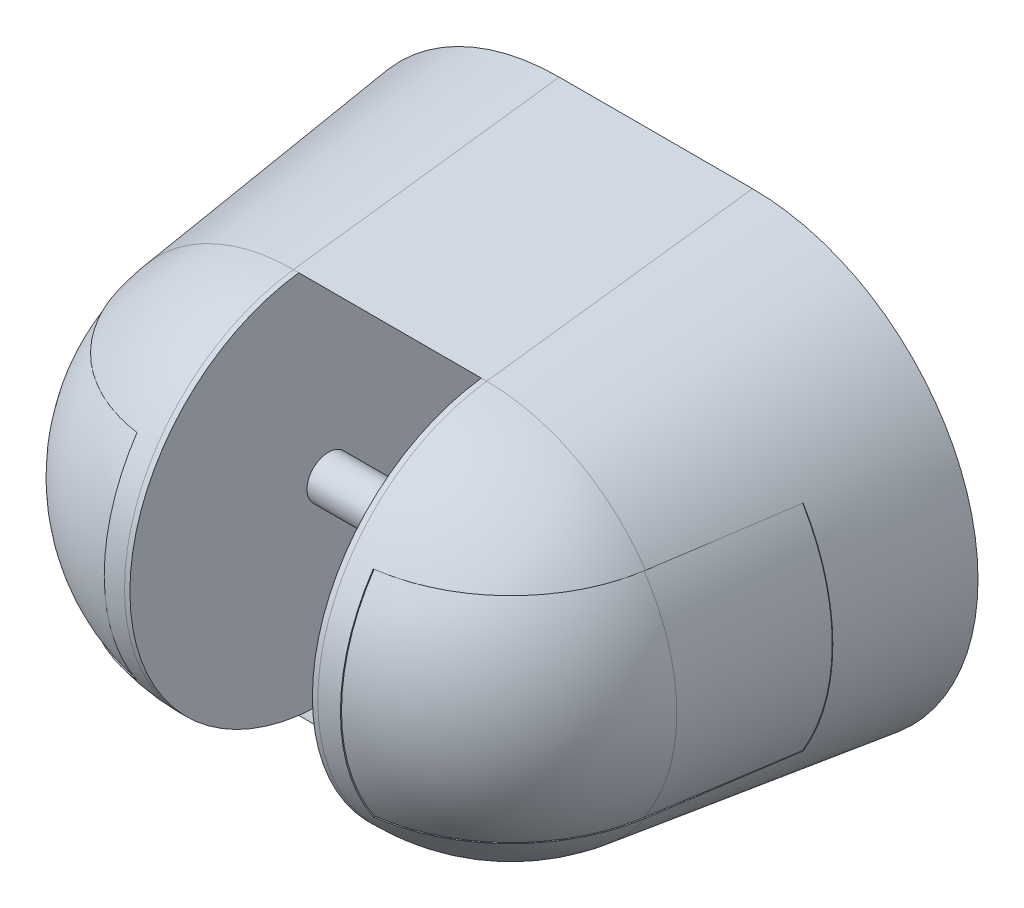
ISO-10303-21;
HEADER;
FILE_DESCRIPTION(('STEP AP214'),'2;1');
FILE_NAME('part.step','',(''),(''),'','','');
FILE_SCHEMA(('AUTOMOTIVE_DESIGN { 1 0 10303 214 1 1 1 1 }'));
ENDSEC;
DATA;
#1=APPLICATION_CONTEXT('core data for automotive mechanical design processes');
#2=APPLICATION_PROTOCOL_DEFINITION('international standard','automotive_design',2000,#1);
#3=PRODUCT_CONTEXT('',#1,'mechanical');
#4=PRODUCT('Part','Part','',(#3));
#5=PRODUCT_RELATED_PRODUCT_CATEGORY('part','',(#4));
#6=PRODUCT_DEFINITION_FORMATION('','',#4);
#7=PRODUCT_DEFINITION_CONTEXT('part definition',#1,'design');
#8=PRODUCT_DEFINITION('design','',#6,#7);
#9=PRODUCT_DEFINITION_SHAPE('','',#8);
#10=(LENGTH_UNIT() NAMED_UNIT(*) SI_UNIT(.MILLI.,.METRE.));
#11=(NAMED_UNIT(*) PLANE_ANGLE_UNIT() SI_UNIT($,.RADIAN.));
#12=(NAMED_UNIT(*) SI_UNIT($,.STERADIAN.) SOLID_ANGLE_UNIT());
#13=UNCERTAINTY_MEASURE_WITH_UNIT(LENGTH_MEASURE(1.E-05),#10,'distance_accuracy_value','');
#14=(GEOMETRIC_REPRESENTATION_CONTEXT(3) GLOBAL_UNCERTAINTY_ASSIGNED_CONTEXT((#13)) GLOBAL_UNIT_ASSIGNED_CONTEXT((#10,
#11,#12)) REPRESENTATION_CONTEXT('',''));
#15=CARTESIAN_POINT('',(0.,0.,0.));
#16=DIRECTION('',(0.,0.,1.));
#17=DIRECTION('',(1.,0.,0.));
#18=AXIS2_PLACEMENT_3D('',#15,#16,#17);
#19=CARTESIAN_POINT('',(22.625,0.,11.5));
#20=DIRECTION('',(0.,0.,1.));
#21=DIRECTION('',(0.,-1.,0.));
#22=AXIS2_PLACEMENT_3D('',#19,#20,#21);
#23=PLANE('',#22);
#24=CARTESIAN_POINT('',(20.,0.,11.5));
#25=DIRECTION('',(0.,0.,-1.));
#26=DIRECTION('',(0.,1.,0.));
#27=AXIS2_PLACEMENT_3D('',#24,#25,#26);
#28=CIRCLE('',#27,5.25);
#29=CARTESIAN_POINT('',(20.,5.25,11.5));
#30=VERTEX_POINT('',#29);
#31=EDGE_CURVE('E17',#30,#30,#28,.T.);
#32=ORIENTED_EDGE('',*,*,#31,.T.);
#33=EDGE_LOOP('',(#32));
#34=FACE_BOUND('',#33,.T.);
#35=ADVANCED_FACE('F14',(#34),#23,.F.);
#36=CARTESIAN_POINT('',(-17.375,0.,11.5));
#37=DIRECTION('',(0.,0.,1.));
#38=DIRECTION('',(0.,-1.,0.));
#39=AXIS2_PLACEMENT_3D('',#36,#37,#38);
#40=PLANE('',#39);
#41=CARTESIAN_POINT('',(-20.,0.,11.5));
#42=DIRECTION('',(0.,0.,-1.));
#43=DIRECTION('',(0.,1.,0.));
#44=AXIS2_PLACEMENT_3D('',#41,#42,#43);
#45=CIRCLE('',#44,5.25);
#46=CARTESIAN_POINT('',(-20.,5.25,11.5));
#47=VERTEX_POINT('',#46);
#48=EDGE_CURVE('E439',#47,#47,#45,.T.);
#49=ORIENTED_EDGE('',*,*,#48,.T.);
#50=EDGE_LOOP('',(#49));
#51=FACE_BOUND('',#50,.T.);
#52=ADVANCED_FACE('F527',(#51),#40,.F.);
#53=CARTESIAN_POINT('',(20.,0.,8.25));
#54=DIRECTION('',(0.,0.,-1.));
#55=DIRECTION('',(0.,1.,0.));
#56=AXIS2_PLACEMENT_3D('',#53,#54,#55);
#57=CYLINDRICAL_SURFACE('',#56,5.25);
#58=ORIENTED_EDGE('',*,*,#31,.F.);
#59=EDGE_LOOP('',(#58));
#60=FACE_BOUND('',#59,.T.);
#61=CARTESIAN_POINT('',(20.,0.,5.));
#62=DIRECTION('',(0.,0.,-1.));
#63=DIRECTION('',(0.,1.,0.));
#64=AXIS2_PLACEMENT_3D('',#61,#62,#63);
#65=CIRCLE('',#64,5.25);
#66=CARTESIAN_POINT('',(20.,5.25,5.));
#67=VERTEX_POINT('',#66);
#68=EDGE_CURVE('E458',#67,#67,#65,.T.);
#69=ORIENTED_EDGE('',*,*,#68,.T.);
#70=EDGE_LOOP('',(#69));
#71=FACE_BOUND('',#70,.T.);
#72=ADVANCED_FACE('F533',(#60,#71),#57,.F.);
#73=CARTESIAN_POINT('',(-20.,0.,8.25));
#74=DIRECTION('',(0.,0.,-1.));
#75=DIRECTION('',(0.,1.,0.));
#76=AXIS2_PLACEMENT_3D('',#73,#74,#75);
#77=CYLINDRICAL_SURFACE('',#76,5.25);
#78=ORIENTED_EDGE('',*,*,#48,.F.);
#79=EDGE_LOOP('',(#78));
#80=FACE_BOUND('',#79,.T.);
#81=CARTESIAN_POINT('',(-20.,0.,5.));
#82=DIRECTION('',(0.,0.,-1.));
#83=DIRECTION('',(0.,1.,0.));
#84=AXIS2_PLACEMENT_3D('',#81,#82,#83);
#85=CIRCLE('',#84,5.25);
#86=CARTESIAN_POINT('',(-20.,5.25,5.));
#87=VERTEX_POINT('',#86);
#88=EDGE_CURVE('E461',#87,#87,#85,.T.);
#89=ORIENTED_EDGE('',*,*,#88,.T.);
#90=EDGE_LOOP('',(#89));
#91=FACE_BOUND('',#90,.T.);
#92=ADVANCED_FACE('F538',(#80,#91),#77,.F.);
#93=CARTESIAN_POINT('',(11.,0.,0.));
#94=DIRECTION('',(1.,0.,0.));
#95=DIRECTION('',(0.,1.,0.));
#96=AXIS2_PLACEMENT_3D('',#93,#94,#95);
#97=PLANE('',#96);
#98=CARTESIAN_POINT('',(11.,0.,22.5));
#99=DIRECTION('',(1.,0.,0.));
#100=DIRECTION('',(0.,1.,0.));
#101=AXIS2_PLACEMENT_3D('',#98,#99,#100);
#102=CIRCLE('',#101,17.8885438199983);
#103=CARTESIAN_POINT('',(11.,-10.,37.3323969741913));
#104=VERTEX_POINT('',#103);
#105=CARTESIAN_POINT('',(11.,10.,37.3323969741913));
#106=VERTEX_POINT('',#105);
#107=EDGE_CURVE('E406',#104,#106,#102,.F.);
#108=ORIENTED_EDGE('',*,*,#107,.F.);
#109=DIRECTION('',(0.,0.,1.));
#110=VECTOR('',#109,1.);
#111=CARTESIAN_POINT('',(11.,-10.,12.));
#112=LINE('',#111,#110);
#113=CARTESIAN_POINT('',(11.,-10.,37.2108803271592));
#114=VERTEX_POINT('',#113);
#115=EDGE_CURVE('E414',#104,#114,#112,.F.);
#116=ORIENTED_EDGE('',*,*,#115,.T.);
#117=CARTESIAN_POINT('',(11.,0.,22.5));
#118=DIRECTION('',(1.,0.,0.));
#119=DIRECTION('',(0.,1.,0.));
#120=AXIS2_PLACEMENT_3D('',#117,#118,#119);
#121=CIRCLE('',#120,17.7879172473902);
#122=CARTESIAN_POINT('',(11.,10.,37.2108803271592));
#123=VERTEX_POINT('',#122);
#124=EDGE_CURVE('E438',#123,#114,#121,.T.);
#125=ORIENTED_EDGE('',*,*,#124,.F.);
#126=DIRECTION('',(0.,0.,1.));
#127=VECTOR('',#126,1.);
#128=CARTESIAN_POINT('',(11.,10.,0.));
#129=LINE('',#128,#127);
#130=EDGE_CURVE('E437',#123,#106,#129,.T.);
#131=ORIENTED_EDGE('',*,*,#130,.T.);
#132=EDGE_LOOP('',(#108,#116,#125,#131));
#133=FACE_BOUND('',#132,.T.);
#134=ADVANCED_FACE('F427',(#133),#97,.T.);
#135=CARTESIAN_POINT('',(9.,0.,22.5));
#136=DIRECTION('',(1.,0.,0.));
#137=DIRECTION('',(0.,0.,1.));
#138=AXIS2_PLACEMENT_3D('',#135,#136,#137);
#139=SPHERICAL_SURFACE('',#138,17.9);
#140=CARTESIAN_POINT('',(23.6641836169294,10.,24.8176968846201));
#141=CARTESIAN_POINT('',(23.5990474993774,10.,25.230103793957));
#142=CARTESIAN_POINT('',(23.5164287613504,10.,25.6397409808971));
#143=CARTESIAN_POINT('',(23.3170103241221,10.,26.450589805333));
#144=CARTESIAN_POINT('',(23.200212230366,10.,26.8518018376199));
#145=CARTESIAN_POINT('',(22.933284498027,10.,27.642741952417));
#146=CARTESIAN_POINT('',(22.7831727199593,10.,28.0324760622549));
#147=CARTESIAN_POINT('',(22.4506644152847,10.,28.7979134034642));
#148=CARTESIAN_POINT('',(22.2682683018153,10.,29.1736168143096));
#149=CARTESIAN_POINT('',(21.8723999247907,10.,29.9084804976));
#150=CARTESIAN_POINT('',(21.6589147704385,10.,30.2676338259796));
#151=CARTESIAN_POINT('',(21.2024439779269,10.,30.9666767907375));
#152=CARTESIAN_POINT('',(20.9594583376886,10.,31.3065664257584));
#153=CARTESIAN_POINT('',(20.4457777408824,10.,31.9645836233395));
#154=CARTESIAN_POINT('',(20.1750896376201,10.,32.2827165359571));
#155=CARTESIAN_POINT('',(19.6078822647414,10.,32.8950468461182));
#156=CARTESIAN_POINT('',(19.3113633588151,10.,33.1892445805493));
#157=CARTESIAN_POINT('',(18.6945594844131,10.,33.7516544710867));
#158=CARTESIAN_POINT('',(18.3742714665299,10.,34.0198632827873));
#159=CARTESIAN_POINT('',(17.7122246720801,10.,34.5283565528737));
#160=CARTESIAN_POINT('',(17.3704650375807,10.,34.7686398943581));
#161=CARTESIAN_POINT('',(16.6679152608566,10.,35.2195644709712));
#162=CARTESIAN_POINT('',(16.3071246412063,10.,35.4302049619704));
#163=CARTESIAN_POINT('',(15.5691121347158,10.,35.8203198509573));
#164=CARTESIAN_POINT('',(15.1918926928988,10.,35.9997988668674));
#165=CARTESIAN_POINT('',(14.5038390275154,10.,36.2922770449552));
#166=CARTESIAN_POINT('',(14.1955620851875,10.,36.4113348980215));
#167=CARTESIAN_POINT('',(13.5717877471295,10.,36.6286165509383));
#168=CARTESIAN_POINT('',(13.2562914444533,10.,36.7268434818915));
#169=CARTESIAN_POINT('',(12.6198021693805,10.,36.901938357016));
#170=CARTESIAN_POINT('',(12.2988155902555,10.,36.9788295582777));
#171=CARTESIAN_POINT('',(11.6523831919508,10.,37.1110867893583));
#172=CARTESIAN_POINT('',(11.3269366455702,10.,37.1664492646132));
#173=CARTESIAN_POINT('',(11.,10.,37.2108803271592));
#174=B_SPLINE_CURVE_WITH_KNOTS('',3,(#140,#141,#142,#143,#144,#145,#146,#147,#148,#149,#150,
#151,#152,#153,#154,#155,#156,#157,#158,#159,#160,#161,#162,#163,#164,#165,#166,#167,#168,#169,
#170,#171,#172,#173),.UNSPECIFIED.,.F.,.F.,(4,2,2,2,2,2,2,2,2,2,2,2,2,2,2,2,4),(0.,
1.25217488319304,2.50429095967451,3.75573735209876,5.00716773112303,6.25911849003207,
7.51106933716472,8.7627112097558,10.0143354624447,11.2661205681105,12.5179557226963,
13.7698222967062,15.0215031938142,16.0122083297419,17.0027644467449,17.9922365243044,
18.9818719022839),.UNSPECIFIED.);
#175=CARTESIAN_POINT('',(23.6641836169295,10.,24.8176968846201));
#176=VERTEX_POINT('',#175);
#177=EDGE_CURVE('E381',#176,#123,#174,.T.);
#178=ORIENTED_EDGE('',*,*,#177,.T.);
#179=ORIENTED_EDGE('',*,*,#124,.T.);
#180=CARTESIAN_POINT('',(11.,-10.,37.2108803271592));
#181=CARTESIAN_POINT('',(11.4137191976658,-10.,37.1546789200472));
#182=CARTESIAN_POINT('',(11.82504743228,-10.,37.0809390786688));
#183=CARTESIAN_POINT('',(12.6400195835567,-10.,36.8991042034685));
#184=CARTESIAN_POINT('',(13.0436638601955,-10.,36.7910107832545));
#185=CARTESIAN_POINT('',(13.8401920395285,-10.,36.5412518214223));
#186=CARTESIAN_POINT('',(14.2330815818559,-10.,36.3996042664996));
#187=CARTESIAN_POINT('',(15.0055313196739,-10.,36.0837285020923));
#188=CARTESIAN_POINT('',(15.3850916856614,-10.,35.9095007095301));
#189=CARTESIAN_POINT('',(16.1283452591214,-10.,35.5296184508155));
#190=CARTESIAN_POINT('',(16.492031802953,-10.,35.3239509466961));
#191=CARTESIAN_POINT('',(17.2007837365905,-10.,34.8827057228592));
#192=CARTESIAN_POINT('',(17.5458491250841,-10.,34.6471280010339));
#193=CARTESIAN_POINT('',(18.2148222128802,-10.,34.1477990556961));
#194=CARTESIAN_POINT('',(18.5387351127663,-10.,33.8840547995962));
#195=CARTESIAN_POINT('',(19.1631896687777,-10.,33.3302234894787));
#196=CARTESIAN_POINT('',(19.4637316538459,-10.,33.0401368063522));
#197=CARTESIAN_POINT('',(20.0393501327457,-10.,32.4356409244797));
#198=CARTESIAN_POINT('',(20.314423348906,-10.,32.1212286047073));
#199=CARTESIAN_POINT('',(20.8371163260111,-10.,31.470334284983));
#200=CARTESIAN_POINT('',(21.0847349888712,-10.,31.1338514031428));
#201=CARTESIAN_POINT('',(21.5507487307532,-10.,30.4412184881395));
#202=CARTESIAN_POINT('',(21.7691430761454,-10.,30.0850679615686));
#203=CARTESIAN_POINT('',(22.1751283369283,-10.,29.3556654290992));
#204=CARTESIAN_POINT('',(22.3627238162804,-10.,28.9824159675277));
#205=CARTESIAN_POINT('',(22.6700147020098,-10.,28.3008489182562));
#206=CARTESIAN_POINT('',(22.7957120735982,-10.,27.9952190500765));
#207=CARTESIAN_POINT('',(23.0264337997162,-10.,27.3762899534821));
#208=CARTESIAN_POINT('',(23.1314612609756,-10.,27.0629918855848));
#209=CARTESIAN_POINT('',(23.3202810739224,-10.,26.4304384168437));
#210=CARTESIAN_POINT('',(23.4040965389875,-10.,26.1111899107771));
#211=CARTESIAN_POINT('',(23.5503037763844,-10.,25.4677691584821));
#212=CARTESIAN_POINT('',(23.6126920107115,-10.,25.1435961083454));
#213=CARTESIAN_POINT('',(23.6641836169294,-10.,24.8176968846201));
#214=B_SPLINE_CURVE_WITH_KNOTS('',3,(#180,#181,#182,#183,#184,#185,#186,#187,#188,#189,#190,
#191,#192,#193,#194,#195,#196,#197,#198,#199,#200,#201,#202,#203,#204,#205,#206,#207,#208,#209,
#210,#211,#212,#213),.UNSPECIFIED.,.F.,.F.,(4,2,2,2,2,2,2,2,2,2,2,2,2,2,2,2,4),(0.,
1.25217488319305,2.50429095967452,3.75573735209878,5.00716773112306,6.25911849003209,
7.51106933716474,8.76271120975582,10.0143354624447,11.2661205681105,12.5179557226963,
13.7698222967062,15.0215031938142,16.0122083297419,17.0027644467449,17.9922365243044,
18.9818719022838),.UNSPECIFIED.);
#215=CARTESIAN_POINT('',(23.6641836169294,-10.,24.8176968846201));
#216=VERTEX_POINT('',#215);
#217=EDGE_CURVE('E407',#114,#216,#214,.T.);
#218=ORIENTED_EDGE('',*,*,#217,.T.);
#219=CARTESIAN_POINT('',(9.,0.,24.8176968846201));
#220=DIRECTION('',(0.,0.,-1.));
#221=DIRECTION('',(0.,1.,0.));
#222=AXIS2_PLACEMENT_3D('',#219,#220,#221);
#223=CIRCLE('',#222,17.749317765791);
#224=EDGE_CURVE('E445',#176,#216,#223,.T.);
#225=ORIENTED_EDGE('',*,*,#224,.F.);
#226=EDGE_LOOP('',(#178,#179,#218,#225));
#227=FACE_BOUND('',#226,.T.);
#228=ADVANCED_FACE('F421',(#227),#139,.T.);
#229=CARTESIAN_POINT('',(9.,0.,12.));
#230=DIRECTION('',(0.,0.,-1.));
#231=DIRECTION('',(0.,1.,0.));
#232=AXIS2_PLACEMENT_3D('',#229,#230,#231);
#233=CONICAL_SURFACE('',#232,19.4230461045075,0.129844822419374);
#234=CARTESIAN_POINT('',(25.6509675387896,10.,12.));
#235=CARTESIAN_POINT('',(25.4882013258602,10.,13.0685737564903));
#236=CARTESIAN_POINT('',(25.3248218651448,10.,14.1370542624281));
#237=CARTESIAN_POINT('',(24.9967104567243,10.,16.2738054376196));
#238=CARTESIAN_POINT('',(24.83197851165,10.,17.3420761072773));
#239=CARTESIAN_POINT('',(24.5010354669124,10.,19.4783887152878));
#240=CARTESIAN_POINT('',(24.3348243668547,10.,20.5464306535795));
#241=CARTESIAN_POINT('',(24.0007681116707,10.,22.6822610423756));
#242=CARTESIAN_POINT('',(23.8329229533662,10.,23.7500494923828));
#243=CARTESIAN_POINT('',(23.6641836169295,10.,24.8176968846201));
#244=B_SPLINE_CURVE_WITH_KNOTS('',3,(#234,#235,#236,#237,#238,#239,#240,#241,#242,#243),
.UNSPECIFIED.,.F.,.F.,(4,2,2,2,4),(0.,3.24269713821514,6.48538797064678,9.72807966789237,
12.9707776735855),.UNSPECIFIED.);
#245=CARTESIAN_POINT('',(25.6509675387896,10.,12.));
#246=VERTEX_POINT('',#245);
#247=EDGE_CURVE('E376',#246,#176,#244,.T.);
#248=ORIENTED_EDGE('',*,*,#247,.T.);
#249=ORIENTED_EDGE('',*,*,#224,.T.);
#250=CARTESIAN_POINT('',(23.6641836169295,-10.,24.8176968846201));
#251=CARTESIAN_POINT('',(23.8329229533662,-10.,23.7500494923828));
#252=CARTESIAN_POINT('',(24.0007681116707,-10.,22.6822610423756));
#253=CARTESIAN_POINT('',(24.3348243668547,-10.,20.5464306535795));
#254=CARTESIAN_POINT('',(24.5010354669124,-10.,19.4783887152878));
#255=CARTESIAN_POINT('',(24.83197851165,-10.,17.3420761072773));
#256=CARTESIAN_POINT('',(24.9967104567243,-10.,16.2738054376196));
#257=CARTESIAN_POINT('',(25.3248218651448,-10.,14.1370542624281));
#258=CARTESIAN_POINT('',(25.4882013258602,-10.,13.0685737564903));
#259=CARTESIAN_POINT('',(25.6509675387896,-10.,12.));
#260=B_SPLINE_CURVE_WITH_KNOTS('',3,(#250,#251,#252,#253,#254,#255,#256,#257,#258,#259),
.UNSPECIFIED.,.F.,.F.,(4,2,2,2,4),(0.,3.24269800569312,6.48538970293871,9.72808053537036,
12.9707776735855),.UNSPECIFIED.);
#261=CARTESIAN_POINT('',(25.6509675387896,-10.,12.));
#262=VERTEX_POINT('',#261);
#263=EDGE_CURVE('E415',#216,#262,#260,.T.);
#264=ORIENTED_EDGE('',*,*,#263,.T.);
#265=CARTESIAN_POINT('',(9.,0.,12.));
#266=DIRECTION('',(0.,0.,-1.));
#267=DIRECTION('',(0.,1.,0.));
#268=AXIS2_PLACEMENT_3D('',#265,#266,#267);
#269=CIRCLE('',#268,19.4230461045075);
#270=EDGE_CURVE('E161',#262,#246,#269,.F.);
#271=ORIENTED_EDGE('',*,*,#270,.T.);
#272=EDGE_LOOP('',(#248,#249,#264,#271));
#273=FACE_BOUND('',#272,.T.);
#274=ADVANCED_FACE('F426',(#273),#233,.T.);
#275=CARTESIAN_POINT('',(-11.,0.,0.));
#276=DIRECTION('',(1.,0.,0.));
#277=DIRECTION('',(0.,1.,0.));
#278=AXIS2_PLACEMENT_3D('',#275,#276,#277);
#279=PLANE('',#278);
#280=DIRECTION('',(0.,0.,1.));
#281=VECTOR('',#280,1.);
#282=CARTESIAN_POINT('',(-11.,-10.,0.));
#283=LINE('',#282,#281);
#284=CARTESIAN_POINT('',(-11.,-10.,37.3323969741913));
#285=VERTEX_POINT('',#284);
#286=CARTESIAN_POINT('',(-11.,-10.,37.2108803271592));
#287=VERTEX_POINT('',#286);
#288=EDGE_CURVE('E435',#285,#287,#283,.F.);
#289=ORIENTED_EDGE('',*,*,#288,.F.);
#290=CARTESIAN_POINT('',(-11.,0.,22.5));
#291=DIRECTION('',(1.,0.,0.));
#292=DIRECTION('',(0.,1.,0.));
#293=AXIS2_PLACEMENT_3D('',#290,#291,#292);
#294=CIRCLE('',#293,17.8885438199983);
#295=CARTESIAN_POINT('',(-11.,10.,37.3323969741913));
#296=VERTEX_POINT('',#295);
#297=EDGE_CURVE('E228',#296,#285,#294,.T.);
#298=ORIENTED_EDGE('',*,*,#297,.F.);
#299=DIRECTION('',(0.,0.,1.));
#300=VECTOR('',#299,1.);
#301=CARTESIAN_POINT('',(-11.,10.,12.));
#302=LINE('',#301,#300);
#303=CARTESIAN_POINT('',(-11.,10.,37.2108803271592));
#304=VERTEX_POINT('',#303);
#305=EDGE_CURVE('E359',#296,#304,#302,.F.);
#306=ORIENTED_EDGE('',*,*,#305,.T.);
#307=CARTESIAN_POINT('',(-11.,0.,22.5));
#308=DIRECTION('',(1.,0.,0.));
#309=DIRECTION('',(0.,1.,0.));
#310=AXIS2_PLACEMENT_3D('',#307,#308,#309);
#311=CIRCLE('',#310,17.7879172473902);
#312=EDGE_CURVE('E453',#287,#304,#311,.F.);
#313=ORIENTED_EDGE('',*,*,#312,.F.);
#314=EDGE_LOOP('',(#289,#298,#306,#313));
#315=FACE_BOUND('',#314,.T.);
#316=ADVANCED_FACE('F671',(#315),#279,.F.);
#317=CARTESIAN_POINT('',(-9.,0.,22.5));
#318=DIRECTION('',(1.,0.,0.));
#319=DIRECTION('',(0.,0.,1.));
#320=AXIS2_PLACEMENT_3D('',#317,#318,#319);
#321=SPHERICAL_SURFACE('',#320,17.9);
#322=CARTESIAN_POINT('',(-23.6641836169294,-10.,24.8176968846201));
#323=CARTESIAN_POINT('',(-23.5990474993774,-10.,25.230103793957));
#324=CARTESIAN_POINT('',(-23.5164287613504,-10.,25.6397409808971));
#325=CARTESIAN_POINT('',(-23.3170103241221,-10.,26.450589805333));
#326=CARTESIAN_POINT('',(-23.200212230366,-10.,26.8518018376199));
#327=CARTESIAN_POINT('',(-22.933284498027,-10.,27.642741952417));
#328=CARTESIAN_POINT('',(-22.7831727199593,-10.,28.0324760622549));
#329=CARTESIAN_POINT('',(-22.4506644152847,-10.,28.7979134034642));
#330=CARTESIAN_POINT('',(-22.2682683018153,-10.,29.1736168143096));
#331=CARTESIAN_POINT('',(-21.8723999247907,-10.,29.9084804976));
#332=CARTESIAN_POINT('',(-21.6589147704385,-10.,30.2676338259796));
#333=CARTESIAN_POINT('',(-21.2024439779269,-10.,30.9666767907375));
#334=CARTESIAN_POINT('',(-20.9594583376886,-10.,31.3065664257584));
#335=CARTESIAN_POINT('',(-20.4457777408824,-10.,31.9645836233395));
#336=CARTESIAN_POINT('',(-20.1750896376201,-10.,32.2827165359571));
#337=CARTESIAN_POINT('',(-19.6078822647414,-10.,32.8950468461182));
#338=CARTESIAN_POINT('',(-19.3113633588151,-10.,33.1892445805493));
#339=CARTESIAN_POINT('',(-18.6945594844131,-10.,33.7516544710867));
#340=CARTESIAN_POINT('',(-18.3742714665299,-10.,34.0198632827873));
#341=CARTESIAN_POINT('',(-17.7122246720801,-10.,34.5283565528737));
#342=CARTESIAN_POINT('',(-17.3704650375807,-10.,34.7686398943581));
#343=CARTESIAN_POINT('',(-16.6679152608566,-10.,35.2195644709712));
#344=CARTESIAN_POINT('',(-16.3071246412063,-10.,35.4302049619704));
#345=CARTESIAN_POINT('',(-15.5691121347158,-10.,35.8203198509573));
#346=CARTESIAN_POINT('',(-15.1918926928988,-10.,35.9997988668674));
#347=CARTESIAN_POINT('',(-14.5038390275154,-10.,36.2922770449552));
#348=CARTESIAN_POINT('',(-14.1955620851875,-10.,36.4113348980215));
#349=CARTESIAN_POINT('',(-13.5717877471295,-10.,36.6286165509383));
#350=CARTESIAN_POINT('',(-13.2562914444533,-10.,36.7268434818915));
#351=CARTESIAN_POINT('',(-12.6198021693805,-10.,36.901938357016));
#352=CARTESIAN_POINT('',(-12.2988155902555,-10.,36.9788295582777));
#353=CARTESIAN_POINT('',(-11.6523831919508,-10.,37.1110867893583));
#354=CARTESIAN_POINT('',(-11.3269366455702,-10.,37.1664492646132));
#355=CARTESIAN_POINT('',(-11.,-10.,37.2108803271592));
#356=B_SPLINE_CURVE_WITH_KNOTS('',3,(#322,#323,#324,#325,#326,#327,#328,#329,#330,#331,#332,
#333,#334,#335,#336,#337,#338,#339,#340,#341,#342,#343,#344,#345,#346,#347,#348,#349,#350,#351,
#352,#353,#354,#355),.UNSPECIFIED.,.F.,.F.,(4,2,2,2,2,2,2,2,2,2,2,2,2,2,2,2,4),(0.,
1.25217488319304,2.50429095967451,3.75573735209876,5.00716773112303,6.25911849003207,
7.51106933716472,8.7627112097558,10.0143354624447,11.2661205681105,12.5179557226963,
13.7698222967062,15.0215031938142,16.0122083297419,17.0027644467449,17.9922365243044,
18.9818719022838),.UNSPECIFIED.);
#357=CARTESIAN_POINT('',(-23.6641836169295,-10.,24.8176968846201));
#358=VERTEX_POINT('',#357);
#359=EDGE_CURVE('E195',#358,#287,#356,.T.);
#360=ORIENTED_EDGE('',*,*,#359,.T.);
#361=ORIENTED_EDGE('',*,*,#312,.T.);
#362=CARTESIAN_POINT('',(-11.,10.,37.2108803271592));
#363=CARTESIAN_POINT('',(-11.4137191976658,10.,37.1546789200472));
#364=CARTESIAN_POINT('',(-11.82504743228,10.,37.0809390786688));
#365=CARTESIAN_POINT('',(-12.6400195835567,10.,36.8991042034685));
#366=CARTESIAN_POINT('',(-13.0436638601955,10.,36.7910107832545));
#367=CARTESIAN_POINT('',(-13.8401920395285,10.,36.5412518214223));
#368=CARTESIAN_POINT('',(-14.2330815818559,10.,36.3996042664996));
#369=CARTESIAN_POINT('',(-15.0055313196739,10.,36.0837285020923));
#370=CARTESIAN_POINT('',(-15.3850916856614,10.,35.9095007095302));
#371=CARTESIAN_POINT('',(-16.1283452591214,10.,35.5296184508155));
#372=CARTESIAN_POINT('',(-16.492031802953,10.,35.3239509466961));
#373=CARTESIAN_POINT('',(-17.2007837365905,10.,34.8827057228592));
#374=CARTESIAN_POINT('',(-17.5458491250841,10.,34.6471280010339));
#375=CARTESIAN_POINT('',(-18.2148222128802,10.,34.1477990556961));
#376=CARTESIAN_POINT('',(-18.5387351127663,10.,33.8840547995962));
#377=CARTESIAN_POINT('',(-19.1631896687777,10.,33.3302234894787));
#378=CARTESIAN_POINT('',(-19.4637316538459,10.,33.0401368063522));
#379=CARTESIAN_POINT('',(-20.0393501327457,10.,32.4356409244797));
#380=CARTESIAN_POINT('',(-20.314423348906,10.,32.1212286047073));
#381=CARTESIAN_POINT('',(-20.8371163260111,10.,31.470334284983));
#382=CARTESIAN_POINT('',(-21.0847349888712,10.,31.1338514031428));
#383=CARTESIAN_POINT('',(-21.5507487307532,10.,30.4412184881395));
#384=CARTESIAN_POINT('',(-21.7691430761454,10.,30.0850679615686));
#385=CARTESIAN_POINT('',(-22.1751283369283,10.,29.3556654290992));
#386=CARTESIAN_POINT('',(-22.3627238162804,10.,28.9824159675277));
#387=CARTESIAN_POINT('',(-22.6700147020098,10.,28.3008489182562));
#388=CARTESIAN_POINT('',(-22.7957120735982,10.,27.9952190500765));
#389=CARTESIAN_POINT('',(-23.0264337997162,10.,27.3762899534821));
#390=CARTESIAN_POINT('',(-23.1314612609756,10.,27.0629918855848));
#391=CARTESIAN_POINT('',(-23.3202810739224,10.,26.4304384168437));
#392=CARTESIAN_POINT('',(-23.4040965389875,10.,26.1111899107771));
#393=CARTESIAN_POINT('',(-23.5503037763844,10.,25.4677691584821));
#394=CARTESIAN_POINT('',(-23.6126920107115,10.,25.1435961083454));
#395=CARTESIAN_POINT('',(-23.6641836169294,10.,24.8176968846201));
#396=B_SPLINE_CURVE_WITH_KNOTS('',3,(#362,#363,#364,#365,#366,#367,#368,#369,#370,#371,#372,
#373,#374,#375,#376,#377,#378,#379,#380,#381,#382,#383,#384,#385,#386,#387,#388,#389,#390,#391,
#392,#393,#394,#395),.UNSPECIFIED.,.F.,.F.,(4,2,2,2,2,2,2,2,2,2,2,2,2,2,2,2,4),(0.,
1.25217488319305,2.50429095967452,3.75573735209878,5.00716773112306,6.25911849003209,
7.51106933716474,8.76271120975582,10.0143354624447,11.2661205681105,12.5179557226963,
13.7698222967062,15.0215031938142,16.0122083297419,17.0027644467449,17.9922365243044,
18.9818719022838),.UNSPECIFIED.);
#397=CARTESIAN_POINT('',(-23.6641836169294,10.,24.8176968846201));
#398=VERTEX_POINT('',#397);
#399=EDGE_CURVE('E244',#304,#398,#396,.T.);
#400=ORIENTED_EDGE('',*,*,#399,.T.);
#401=CARTESIAN_POINT('',(-9.,0.,24.8176968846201));
#402=DIRECTION('',(0.,0.,-1.));
#403=DIRECTION('',(0.,1.,0.));
#404=AXIS2_PLACEMENT_3D('',#401,#402,#403);
#405=CIRCLE('',#404,17.749317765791);
#406=EDGE_CURVE('E456',#358,#398,#405,.T.);
#407=ORIENTED_EDGE('',*,*,#406,.F.);
#408=EDGE_LOOP('',(#360,#361,#400,#407));
#409=FACE_BOUND('',#408,.T.);
#410=ADVANCED_FACE('F473',(#409),#321,.T.);
#411=CARTESIAN_POINT('',(-9.,0.,12.));
#412=DIRECTION('',(0.,0.,-1.));
#413=DIRECTION('',(0.,1.,0.));
#414=AXIS2_PLACEMENT_3D('',#411,#412,#413);
#415=CONICAL_SURFACE('',#414,19.4230461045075,0.129844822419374);
#416=CARTESIAN_POINT('',(-25.6509675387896,-10.,12.));
#417=CARTESIAN_POINT('',(-25.4882013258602,-10.,13.0685737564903));
#418=CARTESIAN_POINT('',(-25.3248218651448,-10.,14.1370542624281));
#419=CARTESIAN_POINT('',(-24.9967104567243,-10.,16.2738054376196));
#420=CARTESIAN_POINT('',(-24.83197851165,-10.,17.3420761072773));
#421=CARTESIAN_POINT('',(-24.5010354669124,-10.,19.4783887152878));
#422=CARTESIAN_POINT('',(-24.3348243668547,-10.,20.5464306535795));
#423=CARTESIAN_POINT('',(-24.0007681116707,-10.,22.6822610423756));
#424=CARTESIAN_POINT('',(-23.8329229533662,-10.,23.7500494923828));
#425=CARTESIAN_POINT('',(-23.6641836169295,-10.,24.8176968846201));
#426=B_SPLINE_CURVE_WITH_KNOTS('',3,(#416,#417,#418,#419,#420,#421,#422,#423,#424,#425),
.UNSPECIFIED.,.F.,.F.,(4,2,2,2,4),(0.,3.24269713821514,6.48538797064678,9.72807966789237,
12.9707776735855),.UNSPECIFIED.);
#427=CARTESIAN_POINT('',(-25.6509675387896,-10.,12.));
#428=VERTEX_POINT('',#427);
#429=EDGE_CURVE('E477',#428,#358,#426,.T.);
#430=ORIENTED_EDGE('',*,*,#429,.T.);
#431=ORIENTED_EDGE('',*,*,#406,.T.);
#432=CARTESIAN_POINT('',(-23.6641836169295,10.,24.8176968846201));
#433=CARTESIAN_POINT('',(-23.8329229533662,10.,23.7500494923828));
#434=CARTESIAN_POINT('',(-24.0007681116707,10.,22.6822610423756));
#435=CARTESIAN_POINT('',(-24.3348243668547,10.,20.5464306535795));
#436=CARTESIAN_POINT('',(-24.5010354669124,10.,19.4783887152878));
#437=CARTESIAN_POINT('',(-24.83197851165,10.,17.3420761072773));
#438=CARTESIAN_POINT('',(-24.9967104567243,10.,16.2738054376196));
#439=CARTESIAN_POINT('',(-25.3248218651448,10.,14.1370542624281));
#440=CARTESIAN_POINT('',(-25.4882013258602,10.,13.0685737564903));
#441=CARTESIAN_POINT('',(-25.6509675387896,10.,12.));
#442=B_SPLINE_CURVE_WITH_KNOTS('',3,(#432,#433,#434,#435,#436,#437,#438,#439,#440,#441),
.UNSPECIFIED.,.F.,.F.,(4,2,2,2,4),(0.,3.24269800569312,6.48538970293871,9.72808053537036,
12.9707776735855),.UNSPECIFIED.);
#443=CARTESIAN_POINT('',(-25.6509675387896,10.,12.));
#444=VERTEX_POINT('',#443);
#445=EDGE_CURVE('E463',#398,#444,#442,.T.);
#446=ORIENTED_EDGE('',*,*,#445,.T.);
#447=CARTESIAN_POINT('',(-9.,0.,12.));
#448=DIRECTION('',(0.,0.,-1.));
#449=DIRECTION('',(0.,1.,0.));
#450=AXIS2_PLACEMENT_3D('',#447,#448,#449);
#451=CIRCLE('',#450,19.4230461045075);
#452=EDGE_CURVE('E192',#444,#428,#451,.F.);
#453=ORIENTED_EDGE('',*,*,#452,.T.);
#454=EDGE_LOOP('',(#430,#431,#446,#453));
#455=FACE_BOUND('',#454,.T.);
#456=ADVANCED_FACE('F469',(#455),#415,.T.);
#457=CARTESIAN_POINT('',(24.2,0.,5.));
#458=DIRECTION('',(0.,0.,-1.));
#459=DIRECTION('',(0.,1.,0.));
#460=AXIS2_PLACEMENT_3D('',#457,#458,#459);
#461=PLANE('',#460);
#462=CARTESIAN_POINT('',(20.,0.,5.));
#463=DIRECTION('',(0.,0.,-1.));
#464=DIRECTION('',(0.,1.,0.));
#465=AXIS2_PLACEMENT_3D('',#462,#463,#464);
#466=CIRCLE('',#465,3.15);
#467=CARTESIAN_POINT('',(20.,3.15,5.));
#468=VERTEX_POINT('',#467);
#469=EDGE_CURVE('E490',#468,#468,#466,.T.);
#470=ORIENTED_EDGE('',*,*,#469,.T.);
#471=EDGE_LOOP('',(#470));
#472=FACE_BOUND('',#471,.T.);
#473=ORIENTED_EDGE('',*,*,#68,.F.);
#474=EDGE_LOOP('',(#473));
#475=FACE_BOUND('',#474,.T.);
#476=ADVANCED_FACE('F472',(#472,#475),#461,.F.);
#477=CARTESIAN_POINT('',(-15.8,0.,5.));
#478=DIRECTION('',(0.,0.,-1.));
#479=DIRECTION('',(0.,1.,0.));
#480=AXIS2_PLACEMENT_3D('',#477,#478,#479);
#481=PLANE('',#480);
#482=CARTESIAN_POINT('',(-20.,0.,5.));
#483=DIRECTION('',(0.,0.,-1.));
#484=DIRECTION('',(0.,1.,0.));
#485=AXIS2_PLACEMENT_3D('',#482,#483,#484);
#486=CIRCLE('',#485,3.15);
#487=CARTESIAN_POINT('',(-20.,3.15,5.));
#488=VERTEX_POINT('',#487);
#489=EDGE_CURVE('E263',#488,#488,#486,.T.);
#490=ORIENTED_EDGE('',*,*,#489,.T.);
#491=EDGE_LOOP('',(#490));
#492=FACE_BOUND('',#491,.T.);
#493=ORIENTED_EDGE('',*,*,#88,.F.);
#494=EDGE_LOOP('',(#493));
#495=FACE_BOUND('',#494,.T.);
#496=ADVANCED_FACE('F236',(#492,#495),#481,.F.);
#497=CARTESIAN_POINT('',(-11.,10.,12.));
#498=DIRECTION('',(0.,1.,0.));
#499=DIRECTION('',(-1.,0.,0.));
#500=AXIS2_PLACEMENT_3D('',#497,#498,#499);
#501=PLANE('',#500);
#502=ORIENTED_EDGE('',*,*,#305,.F.);
#503=CARTESIAN_POINT('',(-23.7940476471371,10.,24.7663084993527));
#504=CARTESIAN_POINT('',(-23.7303574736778,10.,25.1823650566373));
#505=CARTESIAN_POINT('',(-23.649030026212,10.,25.5957131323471));
#506=CARTESIAN_POINT('',(-23.4518773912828,10.,26.4140791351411));
#507=CARTESIAN_POINT('',(-23.3360538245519,10.,26.8190974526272));
#508=CARTESIAN_POINT('',(-23.0707490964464,10.,27.6177212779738));
#509=CARTESIAN_POINT('',(-22.9212855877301,10.,28.0113326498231));
#510=CARTESIAN_POINT('',(-22.5897448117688,10.,28.784565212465));
#511=CARTESIAN_POINT('',(-22.4076679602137,10.,29.1641865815));
#512=CARTESIAN_POINT('',(-22.0121067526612,10.,29.9069009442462));
#513=CARTESIAN_POINT('',(-21.7986093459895,10.,30.2699869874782));
#514=CARTESIAN_POINT('',(-21.3417825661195,10.,30.9768802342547));
#515=CARTESIAN_POINT('',(-21.0984531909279,10.,31.3206874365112));
#516=CARTESIAN_POINT('',(-20.5837596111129,10.,31.9864913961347));
#517=CARTESIAN_POINT('',(-20.3124027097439,10.,32.3084937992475));
#518=CARTESIAN_POINT('',(-19.7435341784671,10.,32.9284933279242));
#519=CARTESIAN_POINT('',(-19.4460228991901,10.,33.2264907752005));
#520=CARTESIAN_POINT('',(-18.826921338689,10.,33.7964003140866));
#521=CARTESIAN_POINT('',(-18.5053282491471,10.,34.0683093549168));
#522=CARTESIAN_POINT('',(-17.8403656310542,10.,34.5840798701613));
#523=CARTESIAN_POINT('',(-17.4969952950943,10.,34.8279403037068));
#524=CARTESIAN_POINT('',(-16.7909163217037,10.,35.2858793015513));
#525=CARTESIAN_POINT('',(-16.4282065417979,10.,35.4999561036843));
#526=CARTESIAN_POINT('',(-15.6860705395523,10.,35.8967706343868));
#527=CARTESIAN_POINT('',(-15.306646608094,10.,36.0795126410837));
#528=CARTESIAN_POINT('',(-14.6077314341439,10.,36.3805319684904));
#529=CARTESIAN_POINT('',(-14.2906558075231,10.,36.5044541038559));
#530=CARTESIAN_POINT('',(-13.6488288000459,10.,36.7303939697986));
#531=CARTESIAN_POINT('',(-13.3240785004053,10.,36.8324147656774));
#532=CARTESIAN_POINT('',(-12.668710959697,10.,37.0139943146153));
#533=CARTESIAN_POINT('',(-12.3380998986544,10.,37.0935753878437));
#534=CARTESIAN_POINT('',(-11.6721785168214,10.,37.2300763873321));
#535=CARTESIAN_POINT('',(-11.3368674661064,10.,37.2869927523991));
#536=CARTESIAN_POINT('',(-11.,10.,37.3323969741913));
#537=B_SPLINE_CURVE_WITH_KNOTS('',3,(#503,#504,#505,#506,#507,#508,#509,#510,#511,#512,#513,
#514,#515,#516,#517,#518,#519,#520,#521,#522,#523,#524,#525,#526,#527,#528,#529,#530,#531,#532,
#533,#534,#535,#536),.UNSPECIFIED.,.F.,.F.,(4,2,2,2,2,2,2,2,2,2,2,2,2,2,2,2,4),(0.,
1.26232415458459,2.52458901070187,3.78619302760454,5.04778096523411,6.30989439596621,
7.57200791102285,8.83379337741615,10.0955619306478,11.3574778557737,12.6194405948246,
13.8814779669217,15.1433428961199,16.1638803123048,17.1842748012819,18.2036507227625,
19.2231867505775),.UNSPECIFIED.);
#538=CARTESIAN_POINT('',(-23.7940476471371,10.,24.7663084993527));
#539=VERTEX_POINT('',#538);
#540=EDGE_CURVE('E160',#539,#296,#537,.T.);
#541=ORIENTED_EDGE('',*,*,#540,.F.);
#542=CARTESIAN_POINT('',(-25.7138816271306,10.,12.));
#543=CARTESIAN_POINT('',(-25.5564798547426,10.,13.0642463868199));
#544=CARTESIAN_POINT('',(-25.3985088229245,10.,14.1284087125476));
#545=CARTESIAN_POINT('',(-25.0813162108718,10.,16.2565451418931));
#546=CARTESIAN_POINT('',(-24.9220946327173,10.,17.320519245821));
#547=CARTESIAN_POINT('',(-24.6022883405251,10.,19.4482629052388));
#548=CARTESIAN_POINT('',(-24.441703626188,10.,20.5120324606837));
#549=CARTESIAN_POINT('',(-24.1190344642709,10.,22.6393458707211));
#550=CARTESIAN_POINT('',(-23.9569500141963,10.,23.7028897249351));
#551=CARTESIAN_POINT('',(-23.7940476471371,10.,24.7663084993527));
#552=B_SPLINE_CURVE_WITH_KNOTS('',3,(#542,#543,#544,#545,#546,#547,#548,#549,#550,#551),
.UNSPECIFIED.,.F.,.F.,(4,2,2,2,4),(0.,3.22746981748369,6.45493426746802,9.68239942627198,
12.9098699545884),.UNSPECIFIED.);
#553=CARTESIAN_POINT('',(-25.7138816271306,10.,12.));
#554=VERTEX_POINT('',#553);
#555=EDGE_CURVE('E254',#554,#539,#552,.T.);
#556=ORIENTED_EDGE('',*,*,#555,.F.);
#557=DIRECTION('',(1.,0.,0.));
#558=VECTOR('',#557,1.);
#559=CARTESIAN_POINT('',(-11.,10.,12.));
#560=LINE('',#559,#558);
#561=EDGE_CURVE('E189',#554,#444,#560,.T.);
#562=ORIENTED_EDGE('',*,*,#561,.T.);
#563=ORIENTED_EDGE('',*,*,#445,.F.);
#564=ORIENTED_EDGE('',*,*,#399,.F.);
#565=EDGE_LOOP('',(#502,#541,#556,#562,#563,#564));
#566=FACE_BOUND('',#565,.T.);
#567=ADVANCED_FACE('F230',(#566),#501,.F.);
#568=CARTESIAN_POINT('',(11.,-10.,12.));
#569=DIRECTION('',(0.,-1.,0.));
#570=DIRECTION('',(1.,0.,0.));
#571=AXIS2_PLACEMENT_3D('',#568,#569,#570);
#572=PLANE('',#571);
#573=ORIENTED_EDGE('',*,*,#115,.F.);
#574=CARTESIAN_POINT('',(23.7940476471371,-10.,24.7663084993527));
#575=CARTESIAN_POINT('',(23.7303574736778,-10.,25.1823650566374));
#576=CARTESIAN_POINT('',(23.649030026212,-10.,25.5957131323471));
#577=CARTESIAN_POINT('',(23.4518773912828,-10.,26.4140791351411));
#578=CARTESIAN_POINT('',(23.3360538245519,-10.,26.8190974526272));
#579=CARTESIAN_POINT('',(23.0707490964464,-10.,27.6177212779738));
#580=CARTESIAN_POINT('',(22.9212855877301,-10.,28.0113326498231));
#581=CARTESIAN_POINT('',(22.5897448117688,-10.,28.784565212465));
#582=CARTESIAN_POINT('',(22.4076679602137,-10.,29.1641865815));
#583=CARTESIAN_POINT('',(22.0121067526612,-10.,29.9069009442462));
#584=CARTESIAN_POINT('',(21.7986093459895,-10.,30.2699869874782));
#585=CARTESIAN_POINT('',(21.3417825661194,-10.,30.9768802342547));
#586=CARTESIAN_POINT('',(21.0984531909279,-10.,31.3206874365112));
#587=CARTESIAN_POINT('',(20.5837596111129,-10.,31.9864913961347));
#588=CARTESIAN_POINT('',(20.3124027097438,-10.,32.3084937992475));
#589=CARTESIAN_POINT('',(19.7435341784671,-10.,32.9284933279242));
#590=CARTESIAN_POINT('',(19.4460228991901,-10.,33.2264907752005));
#591=CARTESIAN_POINT('',(18.826921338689,-10.,33.7964003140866));
#592=CARTESIAN_POINT('',(18.5053282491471,-10.,34.0683093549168));
#593=CARTESIAN_POINT('',(17.8403656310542,-10.,34.5840798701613));
#594=CARTESIAN_POINT('',(17.4969952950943,-10.,34.8279403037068));
#595=CARTESIAN_POINT('',(16.7909163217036,-10.,35.2858793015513));
#596=CARTESIAN_POINT('',(16.4282065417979,-10.,35.4999561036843));
#597=CARTESIAN_POINT('',(15.6860705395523,-10.,35.8967706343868));
#598=CARTESIAN_POINT('',(15.306646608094,-10.,36.0795126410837));
#599=CARTESIAN_POINT('',(14.6077314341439,-10.,36.3805319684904));
#600=CARTESIAN_POINT('',(14.2906558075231,-10.,36.5044541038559));
#601=CARTESIAN_POINT('',(13.6488288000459,-10.,36.7303939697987));
#602=CARTESIAN_POINT('',(13.3240785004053,-10.,36.8324147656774));
#603=CARTESIAN_POINT('',(12.668710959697,-10.,37.0139943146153));
#604=CARTESIAN_POINT('',(12.3380998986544,-10.,37.0935753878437));
#605=CARTESIAN_POINT('',(11.6721785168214,-10.,37.2300763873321));
#606=CARTESIAN_POINT('',(11.3368674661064,-10.,37.2869927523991));
#607=CARTESIAN_POINT('',(11.,-10.,37.3323969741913));
#608=B_SPLINE_CURVE_WITH_KNOTS('',3,(#574,#575,#576,#577,#578,#579,#580,#581,#582,#583,#584,
#585,#586,#587,#588,#589,#590,#591,#592,#593,#594,#595,#596,#597,#598,#599,#600,#601,#602,#603,
#604,#605,#606,#607),.UNSPECIFIED.,.F.,.F.,(4,2,2,2,2,2,2,2,2,2,2,2,2,2,2,2,4),(0.,
1.2623241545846,2.5245890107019,3.78619302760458,5.04778096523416,6.30989439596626,
7.57200791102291,8.8337933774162,10.0955619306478,11.3574778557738,12.6194405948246,
13.8814779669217,15.1433428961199,16.1638803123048,17.1842748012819,18.2036507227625,
19.2231867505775),.UNSPECIFIED.);
#609=CARTESIAN_POINT('',(23.7940476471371,-10.,24.7663084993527));
#610=VERTEX_POINT('',#609);
#611=EDGE_CURVE('E400',#610,#104,#608,.T.);
#612=ORIENTED_EDGE('',*,*,#611,.F.);
#613=CARTESIAN_POINT('',(25.7138816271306,-10.,12.));
#614=CARTESIAN_POINT('',(25.5564798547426,-10.,13.0642463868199));
#615=CARTESIAN_POINT('',(25.3985088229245,-10.,14.1284087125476));
#616=CARTESIAN_POINT('',(25.0813162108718,-10.,16.2565451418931));
#617=CARTESIAN_POINT('',(24.9220946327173,-10.,17.320519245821));
#618=CARTESIAN_POINT('',(24.6022883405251,-10.,19.4482629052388));
#619=CARTESIAN_POINT('',(24.441703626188,-10.,20.5120324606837));
#620=CARTESIAN_POINT('',(24.1190344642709,-10.,22.6393458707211));
#621=CARTESIAN_POINT('',(23.9569500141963,-10.,23.7028897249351));
#622=CARTESIAN_POINT('',(23.7940476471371,-10.,24.7663084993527));
#623=B_SPLINE_CURVE_WITH_KNOTS('',3,(#613,#614,#615,#616,#617,#618,#619,#620,#621,#622),
.UNSPECIFIED.,.F.,.F.,(4,2,2,2,4),(0.,3.22746981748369,6.45493426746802,9.68239942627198,
12.9098699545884),.UNSPECIFIED.);
#624=CARTESIAN_POINT('',(25.7138816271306,-10.,12.));
#625=VERTEX_POINT('',#624);
#626=EDGE_CURVE('E170',#625,#610,#623,.T.);
#627=ORIENTED_EDGE('',*,*,#626,.F.);
#628=DIRECTION('',(1.,0.,0.));
#629=VECTOR('',#628,1.);
#630=CARTESIAN_POINT('',(11.,-10.,12.));
#631=LINE('',#630,#629);
#632=EDGE_CURVE('E380',#625,#262,#631,.F.);
#633=ORIENTED_EDGE('',*,*,#632,.T.);
#634=ORIENTED_EDGE('',*,*,#263,.F.);
#635=ORIENTED_EDGE('',*,*,#217,.F.);
#636=EDGE_LOOP('',(#573,#612,#627,#633,#634,#635));
#637=FACE_BOUND('',#636,.T.);
#638=ADVANCED_FACE('F235',(#637),#572,.F.);
#639=CARTESIAN_POINT('',(9.,0.,22.5));
#640=DIRECTION('',(1.,0.,0.));
#641=DIRECTION('',(0.,0.,1.));
#642=AXIS2_PLACEMENT_3D('',#639,#640,#641);
#643=SPHERICAL_SURFACE('',#642,18.);
#644=CARTESIAN_POINT('',(9.,0.,22.5));
#645=DIRECTION('',(1.,0.,0.));
#646=DIRECTION('',(0.,1.,0.));
#647=AXIS2_PLACEMENT_3D('',#644,#645,#646);
#648=CIRCLE('',#647,18.);
#649=CARTESIAN_POINT('',(9.,-17.8567591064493,24.7663084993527));
#650=VERTEX_POINT('',#649);
#651=CARTESIAN_POINT('',(9.,17.8567591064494,24.7663084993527));
#652=VERTEX_POINT('',#651);
#653=EDGE_CURVE('E143',#650,#652,#648,.F.);
#654=ORIENTED_EDGE('',*,*,#653,.F.);
#655=CARTESIAN_POINT('',(9.,0.,24.7663084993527));
#656=DIRECTION('',(0.,0.,-1.));
#657=DIRECTION('',(0.,1.,0.));
#658=AXIS2_PLACEMENT_3D('',#655,#656,#657);
#659=CIRCLE('',#658,17.8567591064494);
#660=EDGE_CURVE('E155',#610,#650,#659,.T.);
#661=ORIENTED_EDGE('',*,*,#660,.F.);
#662=ORIENTED_EDGE('',*,*,#611,.T.);
#663=ORIENTED_EDGE('',*,*,#107,.T.);
#664=CARTESIAN_POINT('',(11.,10.,37.3323969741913));
#665=CARTESIAN_POINT('',(11.417134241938,10.,37.2761962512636));
#666=CARTESIAN_POINT('',(11.8318774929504,10.,37.2023124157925));
#667=CARTESIAN_POINT('',(12.6536553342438,10.,37.0199028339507));
#668=CARTESIAN_POINT('',(13.0606902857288,10.,36.9113787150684));
#669=CARTESIAN_POINT('',(13.8639542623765,10.,36.6604731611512));
#670=CARTESIAN_POINT('',(14.2601888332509,10.,36.5181094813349));
#671=CARTESIAN_POINT('',(15.0392563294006,10.,36.2005221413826));
#672=CARTESIAN_POINT('',(15.4220894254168,10.,36.0252989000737));
#673=CARTESIAN_POINT('',(16.171794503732,10.,35.6431528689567));
#674=CARTESIAN_POINT('',(16.5386597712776,10.,35.4362169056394));
#675=CARTESIAN_POINT('',(17.2536508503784,10.,34.9921712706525));
#676=CARTESIAN_POINT('',(17.6017766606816,10.,34.7550615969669));
#677=CARTESIAN_POINT('',(18.2767253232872,10.,34.2524198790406));
#678=CARTESIAN_POINT('',(18.6035536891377,10.,33.9868952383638));
#679=CARTESIAN_POINT('',(19.2336791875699,10.,33.4292639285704));
#680=CARTESIAN_POINT('',(19.5369766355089,10.,33.137157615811));
#681=CARTESIAN_POINT('',(20.117923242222,10.,32.5284009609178));
#682=CARTESIAN_POINT('',(20.3955694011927,10.,32.2117477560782));
#683=CARTESIAN_POINT('',(20.9232101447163,10.,31.5561642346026));
#684=CARTESIAN_POINT('',(21.1732037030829,10.,31.2172330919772));
#685=CARTESIAN_POINT('',(21.6437613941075,10.,30.5195002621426));
#686=CARTESIAN_POINT('',(21.8643237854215,10.,30.1606974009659));
#687=CARTESIAN_POINT('',(22.2744150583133,10.,29.4258145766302));
#688=CARTESIAN_POINT('',(22.4639481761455,10.,29.0497369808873));
#689=CARTESIAN_POINT('',(22.7774827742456,10.,28.3563459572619));
#690=CARTESIAN_POINT('',(22.9070847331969,10.,28.0415492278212));
#691=CARTESIAN_POINT('',(23.1445257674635,10.,27.4038874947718));
#692=CARTESIAN_POINT('',(23.2523678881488,10.,27.0810236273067));
#693=CARTESIAN_POINT('',(23.4456991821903,10.,26.4290261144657));
#694=CARTESIAN_POINT('',(23.5312105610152,10.,26.0998990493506));
#695=CARTESIAN_POINT('',(23.6796603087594,10.,25.43653905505));
#696=CARTESIAN_POINT('',(23.7425951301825,10.,25.102305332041));
#697=CARTESIAN_POINT('',(23.7940476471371,10.,24.7663084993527));
#698=B_SPLINE_CURVE_WITH_KNOTS('',3,(#664,#665,#666,#667,#668,#669,#670,#671,#672,#673,#674,
#675,#676,#677,#678,#679,#680,#681,#682,#683,#684,#685,#686,#687,#688,#689,#690,#691,#692,#693,
#694,#695,#696,#697),.UNSPECIFIED.,.F.,.F.,(4,2,2,2,2,2,2,2,2,2,2,2,2,2,2,2,4),(0.,
1.2623241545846,2.5245890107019,3.78619302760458,5.04778096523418,6.30989439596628,
7.57200791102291,8.8337933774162,10.0955619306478,11.3574778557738,12.6194405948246,
13.8814779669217,15.1433428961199,16.1638803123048,17.184274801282,18.2036507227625,
19.2231867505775),.UNSPECIFIED.);
#699=CARTESIAN_POINT('',(23.7940476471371,10.,24.7663084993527));
#700=VERTEX_POINT('',#699);
#701=EDGE_CURVE('E371',#106,#700,#698,.T.);
#702=ORIENTED_EDGE('',*,*,#701,.T.);
#703=CARTESIAN_POINT('',(9.,0.,24.7663084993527));
#704=DIRECTION('',(0.,0.,-1.));
#705=DIRECTION('',(0.,1.,0.));
#706=AXIS2_PLACEMENT_3D('',#703,#704,#705);
#707=CIRCLE('',#706,17.8567591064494);
#708=EDGE_CURVE('E158',#652,#700,#707,.T.);
#709=ORIENTED_EDGE('',*,*,#708,.F.);
#710=EDGE_LOOP('',(#654,#661,#662,#663,#702,#709));
#711=FACE_BOUND('',#710,.T.);
#712=ADVANCED_FACE('F153',(#711),#643,.T.);
#713=CARTESIAN_POINT('',(11.,10.,47.));
#714=DIRECTION('',(0.,1.,0.));
#715=DIRECTION('',(-1.,0.,0.));
#716=AXIS2_PLACEMENT_3D('',#713,#714,#715);
#717=PLANE('',#716);
#718=ORIENTED_EDGE('',*,*,#247,.F.);
#719=DIRECTION('',(1.,0.,0.));
#720=VECTOR('',#719,1.);
#721=CARTESIAN_POINT('',(11.,10.,12.));
#722=LINE('',#721,#720);
#723=CARTESIAN_POINT('',(25.7138816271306,10.,12.));
#724=VERTEX_POINT('',#723);
#725=EDGE_CURVE('E373',#246,#724,#722,.T.);
#726=ORIENTED_EDGE('',*,*,#725,.T.);
#727=CARTESIAN_POINT('',(23.7940476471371,10.,24.7663084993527));
#728=CARTESIAN_POINT('',(23.9569500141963,10.,23.7028897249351));
#729=CARTESIAN_POINT('',(24.1190344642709,10.,22.6393458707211));
#730=CARTESIAN_POINT('',(24.441703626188,10.,20.5120324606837));
#731=CARTESIAN_POINT('',(24.6022883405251,10.,19.4482629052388));
#732=CARTESIAN_POINT('',(24.9220946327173,10.,17.320519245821));
#733=CARTESIAN_POINT('',(25.0813162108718,10.,16.2565451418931));
#734=CARTESIAN_POINT('',(25.3985088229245,10.,14.1284087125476));
#735=CARTESIAN_POINT('',(25.5564798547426,10.,13.0642463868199));
#736=CARTESIAN_POINT('',(25.7138816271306,10.,12.));
#737=B_SPLINE_CURVE_WITH_KNOTS('',3,(#727,#728,#729,#730,#731,#732,#733,#734,#735,#736),
.UNSPECIFIED.,.F.,.F.,(4,2,2,2,4),(0.,3.22747052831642,6.45493568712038,9.68240013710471,
12.9098699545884),.UNSPECIFIED.);
#738=EDGE_CURVE('E178',#700,#724,#737,.T.);
#739=ORIENTED_EDGE('',*,*,#738,.F.);
#740=ORIENTED_EDGE('',*,*,#701,.F.);
#741=ORIENTED_EDGE('',*,*,#130,.F.);
#742=ORIENTED_EDGE('',*,*,#177,.F.);
#743=EDGE_LOOP('',(#718,#726,#739,#740,#741,#742));
#744=FACE_BOUND('',#743,.T.);
#745=ADVANCED_FACE('F295',(#744),#717,.F.);
#746=CARTESIAN_POINT('',(11.,10.,12.));
#747=DIRECTION('',(0.,0.,-1.));
#748=DIRECTION('',(0.,1.,0.));
#749=AXIS2_PLACEMENT_3D('',#746,#747,#748);
#750=PLANE('',#749);
#751=ORIENTED_EDGE('',*,*,#632,.F.);
#752=CARTESIAN_POINT('',(9.,0.,12.));
#753=DIRECTION('',(0.,0.,-1.));
#754=DIRECTION('',(0.,1.,0.));
#755=AXIS2_PLACEMENT_3D('',#752,#753,#754);
#756=CIRCLE('',#755,19.4770079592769);
#757=EDGE_CURVE('E176',#724,#625,#756,.T.);
#758=ORIENTED_EDGE('',*,*,#757,.F.);
#759=ORIENTED_EDGE('',*,*,#725,.F.);
#760=ORIENTED_EDGE('',*,*,#270,.F.);
#761=EDGE_LOOP('',(#751,#758,#759,#760));
#762=FACE_BOUND('',#761,.T.);
#763=ADVANCED_FACE('F206',(#762),#750,.F.);
#764=CARTESIAN_POINT('',(-9.,0.,22.5));
#765=DIRECTION('',(1.,0.,0.));
#766=DIRECTION('',(0.,0.,1.));
#767=AXIS2_PLACEMENT_3D('',#764,#765,#766);
#768=SPHERICAL_SURFACE('',#767,18.);
#769=CARTESIAN_POINT('',(-9.,0.,22.5));
#770=DIRECTION('',(1.,0.,0.));
#771=DIRECTION('',(0.,0.,1.));
#772=AXIS2_PLACEMENT_3D('',#769,#770,#771);
#773=CIRCLE('',#772,18.);
#774=CARTESIAN_POINT('',(-9.,-17.8567591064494,24.7663084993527));
#775=VERTEX_POINT('',#774);
#776=CARTESIAN_POINT('',(-9.,17.8567591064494,24.7663084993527));
#777=VERTEX_POINT('',#776);
#778=EDGE_CURVE('E198',#775,#777,#773,.F.);
#779=ORIENTED_EDGE('',*,*,#778,.T.);
#780=CARTESIAN_POINT('',(-9.,0.,24.7663084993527));
#781=DIRECTION('',(0.,0.,-1.));
#782=DIRECTION('',(0.,1.,0.));
#783=AXIS2_PLACEMENT_3D('',#780,#781,#782);
#784=CIRCLE('',#783,17.8567591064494);
#785=EDGE_CURVE('E188',#539,#777,#784,.T.);
#786=ORIENTED_EDGE('',*,*,#785,.F.);
#787=ORIENTED_EDGE('',*,*,#540,.T.);
#788=ORIENTED_EDGE('',*,*,#297,.T.);
#789=CARTESIAN_POINT('',(-11.,-10.,37.3323969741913));
#790=CARTESIAN_POINT('',(-11.417134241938,-10.,37.2761962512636));
#791=CARTESIAN_POINT('',(-11.8318774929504,-10.,37.2023124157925));
#792=CARTESIAN_POINT('',(-12.6536553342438,-10.,37.0199028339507));
#793=CARTESIAN_POINT('',(-13.0606902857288,-10.,36.9113787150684));
#794=CARTESIAN_POINT('',(-13.8639542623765,-10.,36.6604731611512));
#795=CARTESIAN_POINT('',(-14.2601888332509,-10.,36.5181094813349));
#796=CARTESIAN_POINT('',(-15.0392563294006,-10.,36.2005221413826));
#797=CARTESIAN_POINT('',(-15.4220894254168,-10.,36.0252989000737));
#798=CARTESIAN_POINT('',(-16.171794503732,-10.,35.6431528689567));
#799=CARTESIAN_POINT('',(-16.5386597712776,-10.,35.4362169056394));
#800=CARTESIAN_POINT('',(-17.2536508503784,-10.,34.9921712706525));
#801=CARTESIAN_POINT('',(-17.6017766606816,-10.,34.7550615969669));
#802=CARTESIAN_POINT('',(-18.2767253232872,-10.,34.2524198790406));
#803=CARTESIAN_POINT('',(-18.6035536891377,-10.,33.9868952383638));
#804=CARTESIAN_POINT('',(-19.2336791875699,-10.,33.4292639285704));
#805=CARTESIAN_POINT('',(-19.5369766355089,-10.,33.137157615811));
#806=CARTESIAN_POINT('',(-20.117923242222,-10.,32.5284009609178));
#807=CARTESIAN_POINT('',(-20.3955694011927,-10.,32.2117477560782));
#808=CARTESIAN_POINT('',(-20.9232101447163,-10.,31.5561642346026));
#809=CARTESIAN_POINT('',(-21.1732037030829,-10.,31.2172330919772));
#810=CARTESIAN_POINT('',(-21.6437613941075,-10.,30.5195002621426));
#811=CARTESIAN_POINT('',(-21.8643237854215,-10.,30.1606974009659));
#812=CARTESIAN_POINT('',(-22.2744150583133,-10.,29.4258145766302));
#813=CARTESIAN_POINT('',(-22.4639481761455,-10.,29.0497369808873));
#814=CARTESIAN_POINT('',(-22.7774827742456,-10.,28.3563459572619));
#815=CARTESIAN_POINT('',(-22.9070847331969,-10.,28.0415492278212));
#816=CARTESIAN_POINT('',(-23.1445257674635,-10.,27.4038874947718));
#817=CARTESIAN_POINT('',(-23.2523678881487,-10.,27.0810236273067));
#818=CARTESIAN_POINT('',(-23.4456991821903,-10.,26.4290261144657));
#819=CARTESIAN_POINT('',(-23.5312105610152,-10.,26.0998990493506));
#820=CARTESIAN_POINT('',(-23.6796603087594,-10.,25.43653905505));
#821=CARTESIAN_POINT('',(-23.7425951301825,-10.,25.102305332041));
#822=CARTESIAN_POINT('',(-23.7940476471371,-10.,24.7663084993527));
#823=B_SPLINE_CURVE_WITH_KNOTS('',3,(#789,#790,#791,#792,#793,#794,#795,#796,#797,#798,#799,
#800,#801,#802,#803,#804,#805,#806,#807,#808,#809,#810,#811,#812,#813,#814,#815,#816,#817,#818,
#819,#820,#821,#822),.UNSPECIFIED.,.F.,.F.,(4,2,2,2,2,2,2,2,2,2,2,2,2,2,2,2,4),(0.,
1.2623241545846,2.5245890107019,3.78619302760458,5.04778096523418,6.30989439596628,
7.57200791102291,8.8337933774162,10.0955619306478,11.3574778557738,12.6194405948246,
13.8814779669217,15.1433428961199,16.1638803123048,17.184274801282,18.2036507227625,
19.2231867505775),.UNSPECIFIED.);
#824=CARTESIAN_POINT('',(-23.7940476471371,-10.,24.7663084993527));
#825=VERTEX_POINT('',#824);
#826=EDGE_CURVE('E213',#285,#825,#823,.T.);
#827=ORIENTED_EDGE('',*,*,#826,.T.);
#828=CARTESIAN_POINT('',(-9.,0.,24.7663084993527));
#829=DIRECTION('',(0.,0.,-1.));
#830=DIRECTION('',(0.,1.,0.));
#831=AXIS2_PLACEMENT_3D('',#828,#829,#830);
#832=CIRCLE('',#831,17.8567591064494);
#833=EDGE_CURVE('E286',#775,#825,#832,.T.);
#834=ORIENTED_EDGE('',*,*,#833,.F.);
#835=EDGE_LOOP('',(#779,#786,#787,#788,#827,#834));
#836=FACE_BOUND('',#835,.T.);
#837=ADVANCED_FACE('F200',(#836),#768,.T.);
#838=CARTESIAN_POINT('',(-11.,-10.,47.));
#839=DIRECTION('',(0.,-1.,0.));
#840=DIRECTION('',(1.,0.,0.));
#841=AXIS2_PLACEMENT_3D('',#838,#839,#840);
#842=PLANE('',#841);
#843=ORIENTED_EDGE('',*,*,#429,.F.);
#844=DIRECTION('',(1.,0.,0.));
#845=VECTOR('',#844,1.);
#846=CARTESIAN_POINT('',(-11.,-10.,12.));
#847=LINE('',#846,#845);
#848=CARTESIAN_POINT('',(-25.7138816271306,-10.,12.));
#849=VERTEX_POINT('',#848);
#850=EDGE_CURVE('E193',#428,#849,#847,.F.);
#851=ORIENTED_EDGE('',*,*,#850,.T.);
#852=CARTESIAN_POINT('',(-23.7940476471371,-10.,24.7663084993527));
#853=CARTESIAN_POINT('',(-23.9569500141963,-10.,23.7028897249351));
#854=CARTESIAN_POINT('',(-24.1190344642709,-10.,22.6393458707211));
#855=CARTESIAN_POINT('',(-24.441703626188,-10.,20.5120324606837));
#856=CARTESIAN_POINT('',(-24.6022883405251,-10.,19.4482629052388));
#857=CARTESIAN_POINT('',(-24.9220946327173,-10.,17.320519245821));
#858=CARTESIAN_POINT('',(-25.0813162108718,-10.,16.2565451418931));
#859=CARTESIAN_POINT('',(-25.3985088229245,-10.,14.1284087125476));
#860=CARTESIAN_POINT('',(-25.5564798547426,-10.,13.0642463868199));
#861=CARTESIAN_POINT('',(-25.7138816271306,-10.,12.));
#862=B_SPLINE_CURVE_WITH_KNOTS('',3,(#852,#853,#854,#855,#856,#857,#858,#859,#860,#861),
.UNSPECIFIED.,.F.,.F.,(4,2,2,2,4),(0.,3.22747052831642,6.45493568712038,9.68240013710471,
12.9098699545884),.UNSPECIFIED.);
#863=EDGE_CURVE('E277',#825,#849,#862,.T.);
#864=ORIENTED_EDGE('',*,*,#863,.F.);
#865=ORIENTED_EDGE('',*,*,#826,.F.);
#866=ORIENTED_EDGE('',*,*,#288,.T.);
#867=ORIENTED_EDGE('',*,*,#359,.F.);
#868=EDGE_LOOP('',(#843,#851,#864,#865,#866,#867));
#869=FACE_BOUND('',#868,.T.);
#870=ADVANCED_FACE('F205',(#869),#842,.F.);
#871=CARTESIAN_POINT('',(-11.,-10.,12.));
#872=DIRECTION('',(0.,0.,-1.));
#873=DIRECTION('',(0.,1.,0.));
#874=AXIS2_PLACEMENT_3D('',#871,#872,#873);
#875=PLANE('',#874);
#876=ORIENTED_EDGE('',*,*,#561,.F.);
#877=CARTESIAN_POINT('',(-9.,0.,12.));
#878=DIRECTION('',(0.,0.,-1.));
#879=DIRECTION('',(0.,1.,0.));
#880=AXIS2_PLACEMENT_3D('',#877,#878,#879);
#881=CIRCLE('',#880,19.4770079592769);
#882=EDGE_CURVE('E285',#849,#554,#881,.T.);
#883=ORIENTED_EDGE('',*,*,#882,.F.);
#884=ORIENTED_EDGE('',*,*,#850,.F.);
#885=ORIENTED_EDGE('',*,*,#452,.F.);
#886=EDGE_LOOP('',(#876,#883,#884,#885));
#887=FACE_BOUND('',#886,.T.);
#888=ADVANCED_FACE('F354',(#887),#875,.F.);
#889=CARTESIAN_POINT('',(20.,0.,2.5));
#890=DIRECTION('',(0.,0.,-1.));
#891=DIRECTION('',(0.,1.,0.));
#892=AXIS2_PLACEMENT_3D('',#889,#890,#891);
#893=CYLINDRICAL_SURFACE('',#892,3.15);
#894=CARTESIAN_POINT('',(20.,0.,0.));
#895=DIRECTION('',(0.,0.,-1.));
#896=DIRECTION('',(0.,1.,0.));
#897=AXIS2_PLACEMENT_3D('',#894,#895,#896);
#898=CIRCLE('',#897,3.15);
#899=CARTESIAN_POINT('',(20.,3.15,0.));
#900=VERTEX_POINT('',#899);
#901=EDGE_CURVE('E340',#900,#900,#898,.F.);
#902=ORIENTED_EDGE('',*,*,#901,.F.);
#903=EDGE_LOOP('',(#902));
#904=FACE_BOUND('',#903,.T.);
#905=ORIENTED_EDGE('',*,*,#469,.F.);
#906=EDGE_LOOP('',(#905));
#907=FACE_BOUND('',#906,.T.);
#908=ADVANCED_FACE('F501',(#904,#907),#893,.F.);
#909=CARTESIAN_POINT('',(-20.,0.,2.5));
#910=DIRECTION('',(0.,0.,-1.));
#911=DIRECTION('',(0.,1.,0.));
#912=AXIS2_PLACEMENT_3D('',#909,#910,#911);
#913=CYLINDRICAL_SURFACE('',#912,3.15);
#914=CARTESIAN_POINT('',(-20.,0.,0.));
#915=DIRECTION('',(0.,0.,-1.));
#916=DIRECTION('',(0.,1.,0.));
#917=AXIS2_PLACEMENT_3D('',#914,#915,#916);
#918=CIRCLE('',#917,3.15);
#919=CARTESIAN_POINT('',(-20.,3.15,0.));
#920=VERTEX_POINT('',#919);
#921=EDGE_CURVE('E337',#920,#920,#918,.F.);
#922=ORIENTED_EDGE('',*,*,#921,.F.);
#923=EDGE_LOOP('',(#922));
#924=FACE_BOUND('',#923,.T.);
#925=ORIENTED_EDGE('',*,*,#489,.F.);
#926=EDGE_LOOP('',(#925));
#927=FACE_BOUND('',#926,.T.);
#928=ADVANCED_FACE('F499',(#924,#927),#913,.F.);
#929=CARTESIAN_POINT('',(9.,21.,0.));
#930=DIRECTION('',(0.,0.992042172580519,0.125906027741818));
#931=DIRECTION('',(0.,-0.125906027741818,0.992042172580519));
#932=AXIS2_PLACEMENT_3D('',#929,#930,#931);
#933=PLANE('',#932);
#934=DIRECTION('',(0.,-0.125906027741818,0.992042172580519));
#935=VECTOR('',#934,1.);
#936=CARTESIAN_POINT('',(9.,19.4283795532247,12.3831542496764));
#937=LINE('',#936,#935);
#938=CARTESIAN_POINT('',(9.,21.,0.));
#939=VERTEX_POINT('',#938);
#940=EDGE_CURVE('E171',#939,#652,#937,.T.);
#941=ORIENTED_EDGE('',*,*,#940,.F.);
#942=DIRECTION('',(1.,0.,0.));
#943=VECTOR('',#942,1.);
#944=CARTESIAN_POINT('',(9.,21.,0.));
#945=LINE('',#944,#943);
#946=CARTESIAN_POINT('',(-9.,21.,0.));
#947=VERTEX_POINT('',#946);
#948=EDGE_CURVE('E331',#947,#939,#945,.T.);
#949=ORIENTED_EDGE('',*,*,#948,.F.);
#950=DIRECTION('',(0.,-0.125906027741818,0.992042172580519));
#951=VECTOR('',#950,1.);
#952=CARTESIAN_POINT('',(-9.,21.,0.));
#953=LINE('',#952,#951);
#954=EDGE_CURVE('E184',#947,#777,#953,.T.);
#955=ORIENTED_EDGE('',*,*,#954,.T.);
#956=DIRECTION('',(1.,0.,0.));
#957=VECTOR('',#956,1.);
#958=CARTESIAN_POINT('',(9.,17.8567591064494,24.7663084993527));
#959=LINE('',#958,#957);
#960=CARTESIAN_POINT('',(-8.5,17.8567591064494,24.7663084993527));
#961=VERTEX_POINT('',#960);
#962=EDGE_CURVE('E307',#777,#961,#959,.T.);
#963=ORIENTED_EDGE('',*,*,#962,.T.);
#964=CARTESIAN_POINT('',(8.5,17.8567591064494,24.7663084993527));
#965=VERTEX_POINT('',#964);
#966=EDGE_CURVE('E309',#961,#965,#959,.T.);
#967=ORIENTED_EDGE('',*,*,#966,.T.);
#968=EDGE_CURVE('E187',#965,#652,#959,.T.);
#969=ORIENTED_EDGE('',*,*,#968,.T.);
#970=EDGE_LOOP('',(#941,#949,#955,#963,#967,#969));
#971=FACE_BOUND('',#970,.T.);
#972=ADVANCED_FACE('F300',(#971),#933,.T.);
#973=CARTESIAN_POINT('',(9.,0.,0.));
#974=DIRECTION('',(0.,0.,-1.));
#975=DIRECTION('',(0.,1.,0.));
#976=AXIS2_PLACEMENT_3D('',#973,#974,#975);
#977=CONICAL_SURFACE('',#976,21.,0.126241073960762);
#978=ORIENTED_EDGE('',*,*,#738,.T.);
#979=ORIENTED_EDGE('',*,*,#757,.T.);
#980=ORIENTED_EDGE('',*,*,#626,.T.);
#981=ORIENTED_EDGE('',*,*,#660,.T.);
#982=DIRECTION('',(0.,-0.125906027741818,-0.992042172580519));
#983=VECTOR('',#982,1.);
#984=CARTESIAN_POINT('',(9.,-17.8567591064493,24.7663084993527));
#985=LINE('',#984,#983);
#986=CARTESIAN_POINT('',(9.,-21.,0.));
#987=VERTEX_POINT('',#986);
#988=EDGE_CURVE('E167',#987,#650,#985,.F.);
#989=ORIENTED_EDGE('',*,*,#988,.F.);
#990=CARTESIAN_POINT('',(9.,0.,0.));
#991=DIRECTION('',(0.,0.,-1.));
#992=DIRECTION('',(0.,1.,0.));
#993=AXIS2_PLACEMENT_3D('',#990,#991,#992);
#994=CIRCLE('',#993,21.);
#995=EDGE_CURVE('E22',#939,#987,#994,.T.);
#996=ORIENTED_EDGE('',*,*,#995,.F.);
#997=ORIENTED_EDGE('',*,*,#940,.T.);
#998=ORIENTED_EDGE('',*,*,#708,.T.);
#999=EDGE_LOOP('',(#978,#979,#980,#981,#989,#996,#997,#998));
#1000=FACE_BOUND('',#999,.T.);
#1001=ADVANCED_FACE('F165',(#1000),#977,.T.);
#1002=CARTESIAN_POINT('',(9.,-17.8567591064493,24.7663084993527));
#1003=DIRECTION('',(0.,-0.992042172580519,0.125906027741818));
#1004=DIRECTION('',(0.,-0.125906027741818,-0.992042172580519));
#1005=AXIS2_PLACEMENT_3D('',#1002,#1003,#1004);
#1006=PLANE('',#1005);
#1007=ORIENTED_EDGE('',*,*,#988,.T.);
#1008=DIRECTION('',(1.,0.,0.));
#1009=VECTOR('',#1008,1.);
#1010=CARTESIAN_POINT('',(9.,-17.8567591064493,24.7663084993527));
#1011=LINE('',#1010,#1009);
#1012=CARTESIAN_POINT('',(8.5,-17.8567591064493,24.7663084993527));
#1013=VERTEX_POINT('',#1012);
#1014=EDGE_CURVE('E140',#650,#1013,#1011,.F.);
#1015=ORIENTED_EDGE('',*,*,#1014,.T.);
#1016=CARTESIAN_POINT('',(-8.5,-17.8567591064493,24.7663084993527));
#1017=VERTEX_POINT('',#1016);
#1018=EDGE_CURVE('E37',#1013,#1017,#1011,.F.);
#1019=ORIENTED_EDGE('',*,*,#1018,.T.);
#1020=EDGE_CURVE('E148',#1017,#775,#1011,.F.);
#1021=ORIENTED_EDGE('',*,*,#1020,.T.);
#1022=DIRECTION('',(0.,0.125906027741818,0.992042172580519));
#1023=VECTOR('',#1022,1.);
#1024=CARTESIAN_POINT('',(-9.,-19.4283795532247,12.3831542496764));
#1025=LINE('',#1024,#1023);
#1026=CARTESIAN_POINT('',(-9.,-21.,0.));
#1027=VERTEX_POINT('',#1026);
#1028=EDGE_CURVE('E146',#1027,#775,#1025,.T.);
#1029=ORIENTED_EDGE('',*,*,#1028,.F.);
#1030=DIRECTION('',(1.,0.,0.));
#1031=VECTOR('',#1030,1.);
#1032=CARTESIAN_POINT('',(9.,-21.,0.));
#1033=LINE('',#1032,#1031);
#1034=EDGE_CURVE('E9',#987,#1027,#1033,.F.);
#1035=ORIENTED_EDGE('',*,*,#1034,.F.);
#1036=EDGE_LOOP('',(#1007,#1015,#1019,#1021,#1029,#1035));
#1037=FACE_BOUND('',#1036,.T.);
#1038=ADVANCED_FACE('F173',(#1037),#1006,.T.);
#1039=CARTESIAN_POINT('',(-9.,0.,0.));
#1040=DIRECTION('',(0.,0.,-1.));
#1041=DIRECTION('',(0.,1.,0.));
#1042=AXIS2_PLACEMENT_3D('',#1039,#1040,#1041);
#1043=CONICAL_SURFACE('',#1042,21.,0.126241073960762);
#1044=ORIENTED_EDGE('',*,*,#863,.T.);
#1045=ORIENTED_EDGE('',*,*,#882,.T.);
#1046=ORIENTED_EDGE('',*,*,#555,.T.);
#1047=ORIENTED_EDGE('',*,*,#785,.T.);
#1048=ORIENTED_EDGE('',*,*,#954,.F.);
#1049=CARTESIAN_POINT('',(-9.,0.,0.));
#1050=DIRECTION('',(0.,0.,-1.));
#1051=DIRECTION('',(0.,1.,0.));
#1052=AXIS2_PLACEMENT_3D('',#1049,#1050,#1051);
#1053=CIRCLE('',#1052,21.);
#1054=EDGE_CURVE('E333',#1027,#947,#1053,.T.);
#1055=ORIENTED_EDGE('',*,*,#1054,.F.);
#1056=ORIENTED_EDGE('',*,*,#1028,.T.);
#1057=ORIENTED_EDGE('',*,*,#833,.T.);
#1058=EDGE_LOOP('',(#1044,#1045,#1046,#1047,#1048,#1055,#1056,#1057));
#1059=FACE_BOUND('',#1058,.T.);
#1060=ADVANCED_FACE('F266',(#1059),#1043,.T.);
#1061=CARTESIAN_POINT('',(9.,10.5,0.));
#1062=DIRECTION('',(0.,0.,-1.));
#1063=DIRECTION('',(0.,1.,0.));
#1064=AXIS2_PLACEMENT_3D('',#1061,#1062,#1063);
#1065=PLANE('',#1064);
#1066=ORIENTED_EDGE('',*,*,#1034,.T.);
#1067=ORIENTED_EDGE('',*,*,#1054,.T.);
#1068=ORIENTED_EDGE('',*,*,#948,.T.);
#1069=ORIENTED_EDGE('',*,*,#995,.T.);
#1070=EDGE_LOOP('',(#1066,#1067,#1068,#1069));
#1071=FACE_BOUND('',#1070,.T.);
#1072=ORIENTED_EDGE('',*,*,#921,.T.);
#1073=EDGE_LOOP('',(#1072));
#1074=FACE_BOUND('',#1073,.T.);
#1075=ORIENTED_EDGE('',*,*,#901,.T.);
#1076=EDGE_LOOP('',(#1075));
#1077=FACE_BOUND('',#1076,.T.);
#1078=ADVANCED_FACE('F271',(#1071,#1074,#1077),#1065,.T.);
#1079=CARTESIAN_POINT('',(-9.,0.,22.5));
#1080=DIRECTION('',(1.,0.,0.));
#1081=DIRECTION('',(0.,1.,0.));
#1082=AXIS2_PLACEMENT_3D('',#1079,#1080,#1081);
#1083=CYLINDRICAL_SURFACE('',#1082,18.);
#1084=ORIENTED_EDGE('',*,*,#1018,.F.);
#1085=CARTESIAN_POINT('',(8.5,0.,22.5));
#1086=DIRECTION('',(-1.,0.,0.));
#1087=DIRECTION('',(0.,-1.,0.));
#1088=AXIS2_PLACEMENT_3D('',#1085,#1086,#1087);
#1089=CIRCLE('',#1088,18.);
#1090=EDGE_CURVE('E319',#965,#1013,#1089,.T.);
#1091=ORIENTED_EDGE('',*,*,#1090,.F.);
#1092=ORIENTED_EDGE('',*,*,#966,.F.);
#1093=CARTESIAN_POINT('',(-8.5,0.,22.5));
#1094=DIRECTION('',(1.,0.,0.));
#1095=DIRECTION('',(0.,1.,0.));
#1096=AXIS2_PLACEMENT_3D('',#1093,#1094,#1095);
#1097=CIRCLE('',#1096,18.);
#1098=EDGE_CURVE('E324',#1017,#961,#1097,.T.);
#1099=ORIENTED_EDGE('',*,*,#1098,.F.);
#1100=EDGE_LOOP('',(#1084,#1091,#1092,#1099));
#1101=FACE_BOUND('',#1100,.T.);
#1102=ADVANCED_FACE('F320',(#1101),#1083,.F.);
#1103=CARTESIAN_POINT('',(-8.5,0.,22.5));
#1104=DIRECTION('',(1.,0.,0.));
#1105=DIRECTION('',(0.,1.,0.));
#1106=AXIS2_PLACEMENT_3D('',#1103,#1104,#1105);
#1107=PLANE('',#1106);
#1108=EDGE_CURVE('E330',#961,#1017,#1097,.T.);
#1109=ORIENTED_EDGE('',*,*,#1108,.T.);
#1110=ORIENTED_EDGE('',*,*,#1098,.T.);
#1111=EDGE_LOOP('',(#1109,#1110));
#1112=FACE_BOUND('',#1111,.T.);
#1113=CARTESIAN_POINT('',(-8.5,0.,22.0057945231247));
#1114=DIRECTION('',(1.,0.,0.));
#1115=DIRECTION('',(0.,0.,-1.));
#1116=AXIS2_PLACEMENT_3D('',#1113,#1114,#1115);
#1117=CIRCLE('',#1116,2.);
#1118=CARTESIAN_POINT('',(-8.5,0.,20.0057945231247));
#1119=VERTEX_POINT('',#1118);
#1120=EDGE_CURVE('E322',#1119,#1119,#1117,.T.);
#1121=ORIENTED_EDGE('',*,*,#1120,.F.);
#1122=EDGE_LOOP('',(#1121));
#1123=FACE_BOUND('',#1122,.T.);
#1124=ADVANCED_FACE('F517',(#1112,#1123),#1107,.T.);
#1125=CARTESIAN_POINT('',(-8.5,0.,22.5));
#1126=DIRECTION('',(-1.,0.,0.));
#1127=DIRECTION('',(0.,-1.,0.));
#1128=AXIS2_PLACEMENT_3D('',#1125,#1126,#1127);
#1129=CYLINDRICAL_SURFACE('',#1128,18.);
#1130=ORIENTED_EDGE('',*,*,#962,.F.);
#1131=ORIENTED_EDGE('',*,*,#778,.F.);
#1132=ORIENTED_EDGE('',*,*,#1020,.F.);
#1133=ORIENTED_EDGE('',*,*,#1108,.F.);
#1134=EDGE_LOOP('',(#1130,#1131,#1132,#1133));
#1135=FACE_BOUND('',#1134,.T.);
#1136=ADVANCED_FACE('F522',(#1135),#1129,.T.);
#1137=CARTESIAN_POINT('',(8.5,0.,22.5));
#1138=DIRECTION('',(1.,0.,0.));
#1139=DIRECTION('',(0.,1.,0.));
#1140=AXIS2_PLACEMENT_3D('',#1137,#1138,#1139);
#1141=CYLINDRICAL_SURFACE('',#1140,18.);
#1142=ORIENTED_EDGE('',*,*,#653,.T.);
#1143=ORIENTED_EDGE('',*,*,#968,.F.);
#1144=EDGE_CURVE('E29',#1013,#965,#1089,.T.);
#1145=ORIENTED_EDGE('',*,*,#1144,.F.);
#1146=ORIENTED_EDGE('',*,*,#1014,.F.);
#1147=EDGE_LOOP('',(#1142,#1143,#1145,#1146));
#1148=FACE_BOUND('',#1147,.T.);
#1149=ADVANCED_FACE('F142',(#1148),#1141,.T.);
#1150=CARTESIAN_POINT('',(8.5,0.,22.5));
#1151=DIRECTION('',(-1.,0.,0.));
#1152=DIRECTION('',(0.,-1.,0.));
#1153=AXIS2_PLACEMENT_3D('',#1150,#1151,#1152);
#1154=PLANE('',#1153);
#1155=ORIENTED_EDGE('',*,*,#1144,.T.);
#1156=ORIENTED_EDGE('',*,*,#1090,.T.);
#1157=EDGE_LOOP('',(#1155,#1156));
#1158=FACE_BOUND('',#1157,.T.);
#1159=CARTESIAN_POINT('',(8.5,0.,22.0057945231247));
#1160=DIRECTION('',(-1.,0.,0.));
#1161=DIRECTION('',(0.,0.,1.));
#1162=AXIS2_PLACEMENT_3D('',#1159,#1160,#1161);
#1163=CIRCLE('',#1162,2.);
#1164=CARTESIAN_POINT('',(8.5,0.,24.0057945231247));
#1165=VERTEX_POINT('',#1164);
#1166=EDGE_CURVE('E326',#1165,#1165,#1163,.T.);
#1167=ORIENTED_EDGE('',*,*,#1166,.F.);
#1168=EDGE_LOOP('',(#1167));
#1169=FACE_BOUND('',#1168,.T.);
#1170=ADVANCED_FACE('F705',(#1158,#1169),#1154,.T.);
#1171=CARTESIAN_POINT('',(-23.732624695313,0.,22.0057945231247));
#1172=DIRECTION('',(1.,0.,0.));
#1173=DIRECTION('',(0.,0.,-1.));
#1174=AXIS2_PLACEMENT_3D('',#1171,#1172,#1173);
#1175=CYLINDRICAL_SURFACE('',#1174,2.);
#1176=ORIENTED_EDGE('',*,*,#1120,.T.);
#1177=EDGE_LOOP('',(#1176));
#1178=FACE_BOUND('',#1177,.T.);
#1179=ORIENTED_EDGE('',*,*,#1166,.T.);
#1180=EDGE_LOOP('',(#1179));
#1181=FACE_BOUND('',#1180,.T.);
#1182=ADVANCED_FACE('F700',(#1178,#1181),#1175,.T.);
#1183=CLOSED_SHELL('',(#35,#52,#72,#92,#134,#228,#274,#316,#410,#456,#476,#496,#567,#638,#712,
#745,#763,#837,#870,#888,#908,#928,#972,#1001,#1038,#1060,#1078,#1102,#1124,#1136,#1149,#1170,#1182));
#1184=MANIFOLD_SOLID_BREP('B1',#1183);
#1185=ADVANCED_BREP_SHAPE_REPRESENTATION('',(#18,#1184),#14);
#1186=SHAPE_DEFINITION_REPRESENTATION(#9,#1185);
ENDSEC;
END-ISO-10303-21;
